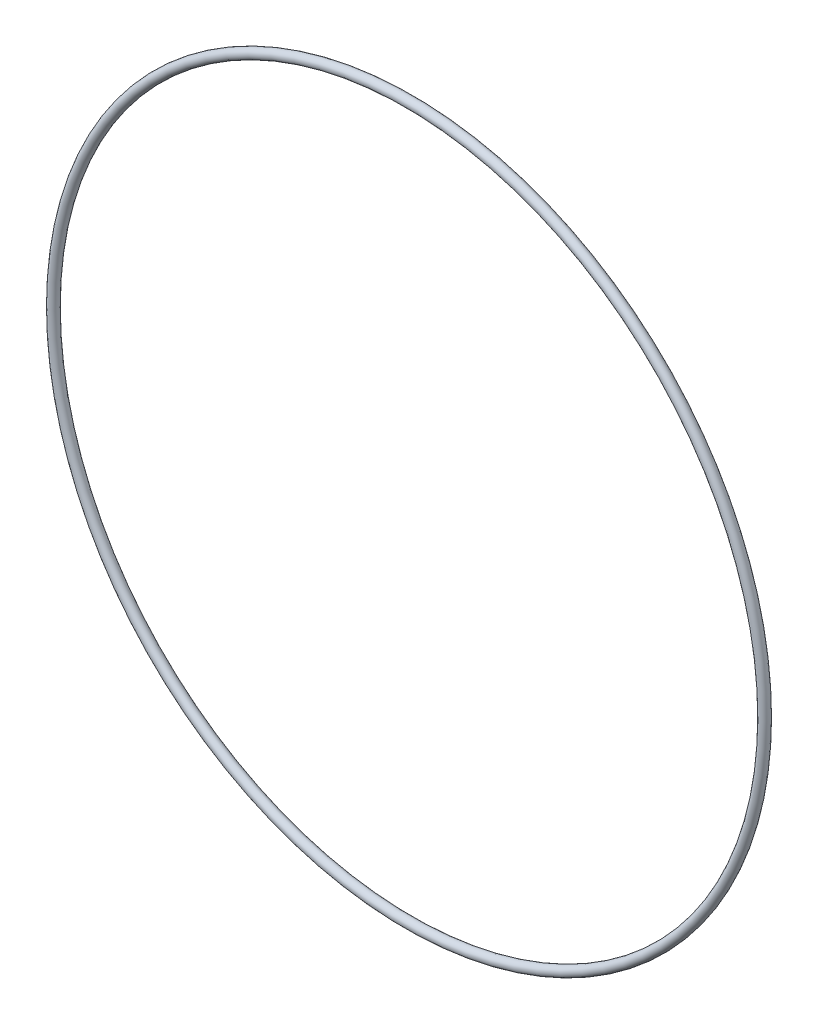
ISO-10303-21;
HEADER;
FILE_DESCRIPTION(('STEP AP214'),'2;1');
FILE_NAME('part.step','',(''),(''),'','','');
FILE_SCHEMA(('AUTOMOTIVE_DESIGN { 1 0 10303 214 1 1 1 1 }'));
ENDSEC;
DATA;
#1=APPLICATION_CONTEXT('core data for automotive mechanical design processes');
#2=APPLICATION_PROTOCOL_DEFINITION('international standard','automotive_design',2000,#1);
#3=PRODUCT_CONTEXT('',#1,'mechanical');
#4=PRODUCT('Part','Part','',(#3));
#5=PRODUCT_RELATED_PRODUCT_CATEGORY('part','',(#4));
#6=PRODUCT_DEFINITION_FORMATION('','',#4);
#7=PRODUCT_DEFINITION_CONTEXT('part definition',#1,'design');
#8=PRODUCT_DEFINITION('design','',#6,#7);
#9=PRODUCT_DEFINITION_SHAPE('','',#8);
#10=(LENGTH_UNIT() NAMED_UNIT(*) SI_UNIT(.MILLI.,.METRE.));
#11=(NAMED_UNIT(*) PLANE_ANGLE_UNIT() SI_UNIT($,.RADIAN.));
#12=(NAMED_UNIT(*) SI_UNIT($,.STERADIAN.) SOLID_ANGLE_UNIT());
#13=UNCERTAINTY_MEASURE_WITH_UNIT(LENGTH_MEASURE(1.E-05),#10,'distance_accuracy_value','');
#14=(GEOMETRIC_REPRESENTATION_CONTEXT(3) GLOBAL_UNCERTAINTY_ASSIGNED_CONTEXT((#13)) GLOBAL_UNIT_ASSIGNED_CONTEXT((#10,
#11,#12)) REPRESENTATION_CONTEXT('',''));
#15=CARTESIAN_POINT('',(0.,0.,0.));
#16=DIRECTION('',(0.,0.,1.));
#17=DIRECTION('',(1.,0.,0.));
#18=AXIS2_PLACEMENT_3D('',#15,#16,#17);
#19=CARTESIAN_POINT('',(0.,0.,0.));
#20=DIRECTION('',(0.,0.,1.));
#21=DIRECTION('',(1.,0.,0.));
#22=AXIS2_PLACEMENT_3D('',#19,#20,#21);
#23=TOROIDAL_SURFACE('',#22,128.5621,1.7653);
#24=CARTESIAN_POINT('',(130.3274,0.,0.));
#25=VERTEX_POINT('',#24);
#26=VERTEX_LOOP('',#25);
#27=FACE_BOUND('',#26,.T.);
#28=ADVANCED_FACE('F26',(#27),#23,.T.);
#29=CLOSED_SHELL('',(#28));
#30=MANIFOLD_SOLID_BREP('B2',#29);
#31=ADVANCED_BREP_SHAPE_REPRESENTATION('',(#18,#30),#14);
#32=SHAPE_DEFINITION_REPRESENTATION(#9,#31);
ENDSEC;
END-ISO-10303-21;
